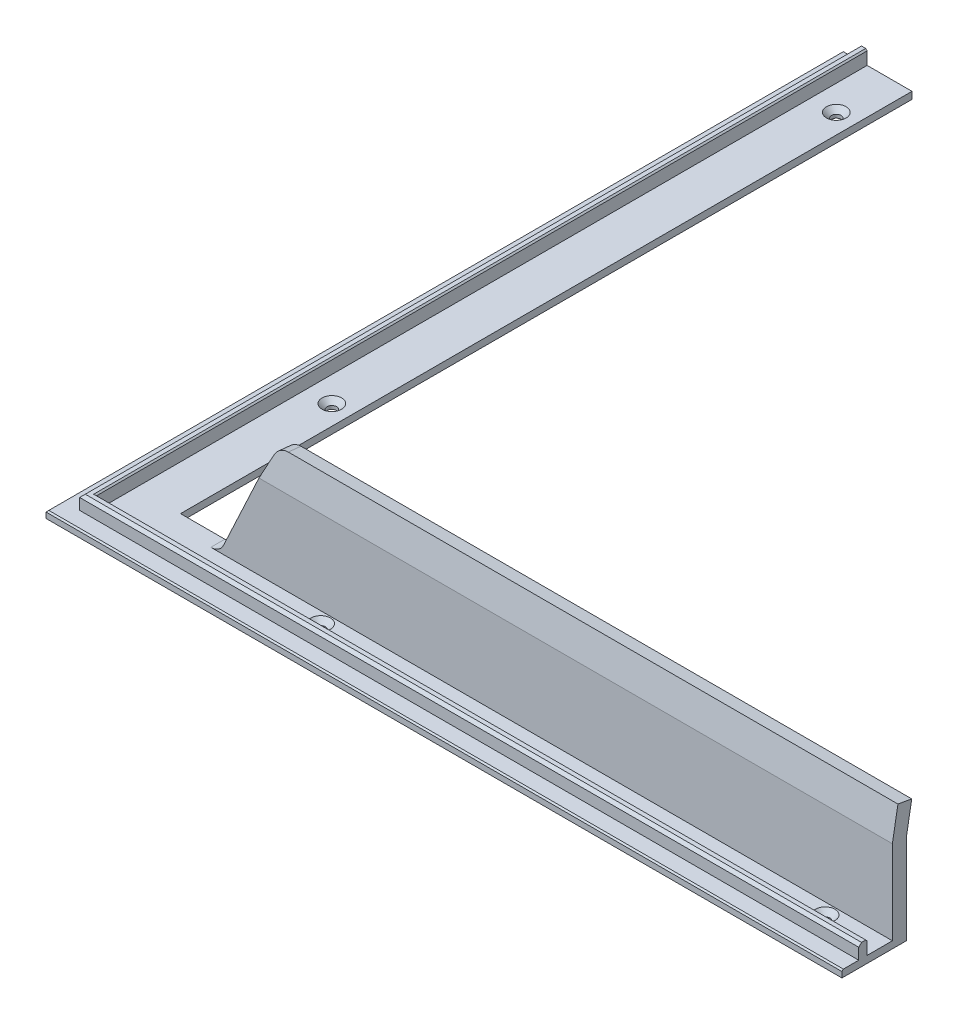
from build123d import *

# Parameters (mm, degrees)
AUFSATZ_LINEAR_AUSTRAGEN1_DEPTH             = 3
AUFSATZ_LINEAR_AUSTRAGEN2_DEPTH             = 5
FASE1_SIZE                                  = 0.5
FASE2_SIZE                                  = 1
FORMSENKUNG_F_R_M3_SENKSCHRAUBE_MIT_2_COUNT = 2
FORMSENKUNG_F_R_M3_SENKSCHRAUBE_MIT_2_PITCH = 180
FORMSENKUNG_F_R_M3_SENKSCHRAUBE_MIT_3_COUNT = 2
FORMSENKUNG_F_R_M3_SENKSCHRAUBE_MIT_3_PITCH = 255.765517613
FORMSENKUNG_F_R_M3_SENKSCHRAUBE_MIT_4_COUNT = 2
FORMSENKUNG_F_R_M3_SENKSCHRAUBE_MIT_4_PITCH = 350.736368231
AUFSATZ_LINEAR_AUSTRAGEN3_DEPTH             = 240
SCHNITT_LINEAR_AUSTRAGEN1_DEPTH             = 374.893398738
VERRUNDUNG1_R                               = 5


with BuildPart() as part:
    # Skizze1 → Aufsatz-Linear austragen1 (new body)
    with BuildSketch(Plane(origin=(0, 0, 0), x_dir=(1, 0, 0), z_dir=(0, 1, 0))):
        Polygon((0, 0), (0, 261), (-25, 261), (-25, -23), (259, -23), (259, 0), align=None)
    extrude(amount=AUFSATZ_LINEAR_AUSTRAGEN1_DEPTH)

    # Skizze2 → Aufsatz-Linear austragen2 (add)
    with BuildSketch(Plane(origin=(0, 3, 0), x_dir=(1, 0, 0), z_dir=(0, 1, 0))):
        Polygon((-19, 261), (-19, -17), (259, -17), (259, -14), (-16, -14), (-16, 261), align=None)
    extrude(amount=AUFSATZ_LINEAR_AUSTRAGEN2_DEPTH)

    # Fase1
    fase1_edges = [part.edges().sort_by_distance(p)[0] for p in [
        (-25, 3, -119),
        (117, 3, 23),
        (121.5, 8, 14),
        (-16, 8, -123.5),
        (259, 0, 11.5),
        (117, 0, 23),
        (-25, 0, -119),
        (-12.5, 0, -261),
        (0, 0, -130.5),
        (129.5, 0, 0),
    ]]
    chamfer(fase1_edges, length=FASE1_SIZE)

    # Fase2
    fase2_edges = [part.edges().sort_by_distance(p)[0] for p in [
        (-19, 8, -122),
        (120, 8, 17),
    ]]
    chamfer(fase2_edges, length=FASE2_SIZE)

    # Skizze4 → Formsenkung f_r M3 Senkschraube mit Inne (revolve, cut)
    with BuildSketch(Plane(origin=(239, 3, 9), x_dir=(0, 0, 1), z_dir=(1, 0, 0))):
        Polygon((0, 0), (0, 3), (1.7, 3), (1.7, 1.8), (3.5, 0), align=None)
    formsenkung_f_r_m3_senkschraube_mit_inne = revolve(axis=Axis((239, 9.35, 9), (0, -1, 0)), mode=Mode.SUBTRACT)

    # Formsenkung f_r M3 Senkschraube mit  2: Formsenkung f_r M3 Senkschraube mit Inne ×2
    with Locations(*[(-i * FORMSENKUNG_F_R_M3_SENKSCHRAUBE_MIT_2_PITCH, 0, 0) for i in range(1, FORMSENKUNG_F_R_M3_SENKSCHRAUBE_MIT_2_COUNT)]):
        add(formsenkung_f_r_m3_senkschraube_mit_inne, mode=Mode.SUBTRACT)

    # Formsenkung f_r M3 Senkschraube mit  3: Formsenkung f_r M3 Senkschraube mit Inne ×2
    with Locations(*[Vector(-0.9618184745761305, 0, -0.2736881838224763) * (i * FORMSENKUNG_F_R_M3_SENKSCHRAUBE_MIT_3_PITCH) for i in range(1, FORMSENKUNG_F_R_M3_SENKSCHRAUBE_MIT_3_COUNT)]):
        add(formsenkung_f_r_m3_senkschraube_mit_inne, mode=Mode.SUBTRACT)

    # Formsenkung f_r M3 Senkschraube mit  4: Formsenkung f_r M3 Senkschraube mit Inne ×2
    with Locations(*[Vector(-0.7013814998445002, 0, -0.712786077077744) * (i * FORMSENKUNG_F_R_M3_SENKSCHRAUBE_MIT_4_PITCH) for i in range(1, FORMSENKUNG_F_R_M3_SENKSCHRAUBE_MIT_4_COUNT)]):
        add(formsenkung_f_r_m3_senkschraube_mit_inne, mode=Mode.SUBTRACT)

    # Skizze5 → Aufsatz-Linear austragen3 (add)
    with BuildSketch(Plane(origin=(259, 0, 0), x_dir=(0, 0, -1), z_dir=(1, 0, 0))):
        Polygon((0, 3), (0, 32.562556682), (1.910129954, 43.395441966), (-3.013908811, 44.263682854), (-5, 33), (-5, 3), align=None)
    extrude(amount=-AUFSATZ_LINEAR_AUSTRAGEN3_DEPTH)

    # Skizze6 → Schnitt-Linear austragen1 (cut, through all)
    with BuildSketch(Plane.XY.offset(5)):
        Polygon((19, 3), (38.241571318, 44.263682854), (19, 44.263682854), align=None)
    extrude(amount=-SCHNITT_LINEAR_AUSTRAGEN1_DEPTH, mode=Mode.SUBTRACT)

    # Verrundung1
    verrundung1_edges = [part.edges().sort_by_distance(p)[0] for p in [
        (19, 3, 2.5),
        (38.039137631, 43.82956241, 0.551889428),
    ]]
    fillet(verrundung1_edges, radius=VERRUNDUNG1_R)


solid = part.part
